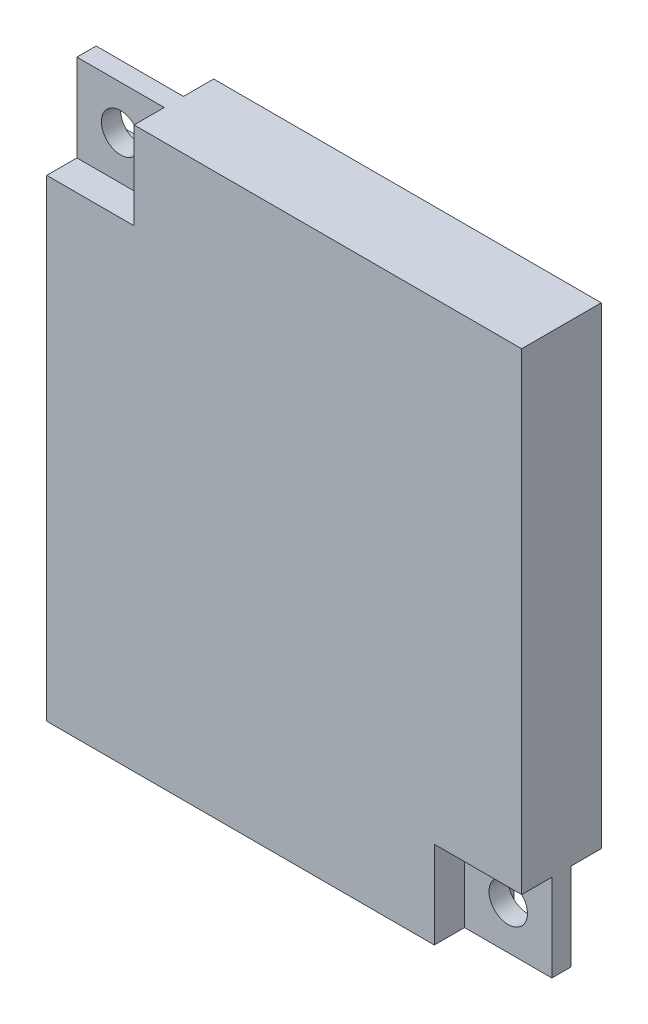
from build123d import *

# Parameters (mm, degrees)
SKETCH1_W          = 21.971
SKETCH1_H          = 25.908
EXTRUDE1_DEPTH     = 0.889
EXTRUDE2_DEPTH     = 1.397
EXTRUDE3_DEPTH     = 1.397
SKETCH4_R          = 0.889
CUT_EXTRUDE1_DEPTH = 35.046660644
SKETCH6_W          = 3.0226
SKETCH6_H          = 8.001
EXTRUDE4_DEPTH     = 4.318


with BuildPart() as part:
    # Sketch1 → Extrude1 (new body)
    with BuildSketch(Plane.XY):
        with Locations((-10.9855, 12.954)):
            Rectangle(SKETCH1_W, SKETCH1_H)
    extrude(amount=EXTRUDE1_DEPTH)

    # Sketch2 → Extrude2 (add)
    with BuildSketch(Plane.XY.offset(0.889)):
        Polygon((-17.9324, 25.908), (-17.9324, 21.8694), (-21.971, 21.8694), (-21.971, 0), (-4.0386, 0), (-4.0386, 4.0386), (0, 4.0386), (0, 25.908), align=None)
    extrude(amount=EXTRUDE2_DEPTH)

    # Sketch3 → Extrude3 (add)
    with BuildSketch(Plane(origin=(0, 0, 0), x_dir=(-1, 0, 0), z_dir=(0, 0, -1))):
        Polygon((4.0386, 0), (4.0386, 4.0386), (0, 4.0386), (0, 25.908), (17.9324, 25.908), (17.9324, 21.8694), (21.971, 21.8694), (21.971, 10.5156), (17.78, 10.5156), (17.78, 0), align=None)
    extrude(amount=EXTRUDE3_DEPTH)

    # Sketch4 → Cut-Extrude1 (cut, through all)
    with BuildSketch(Plane.XY.offset(0.889)):
        with Locations((-19.9517, 23.8887)):
            Circle(SKETCH4_R)
        with Locations((-2.0193, 2.0193)):
            Circle(SKETCH4_R)
    extrude(amount=-CUT_EXTRUDE1_DEPTH, mode=Mode.SUBTRACT)

    # Sketch6 → Extrude4 (add)
    with BuildSketch(Plane(origin=(0, 0, 0), x_dir=(-1, 0, 0), z_dir=(0, 0, -1))):
        with Locations((19.8247, 6.0325)):
            Rectangle(SKETCH6_W, SKETCH6_H)
    extrude(amount=EXTRUDE4_DEPTH)


solid = part.part
